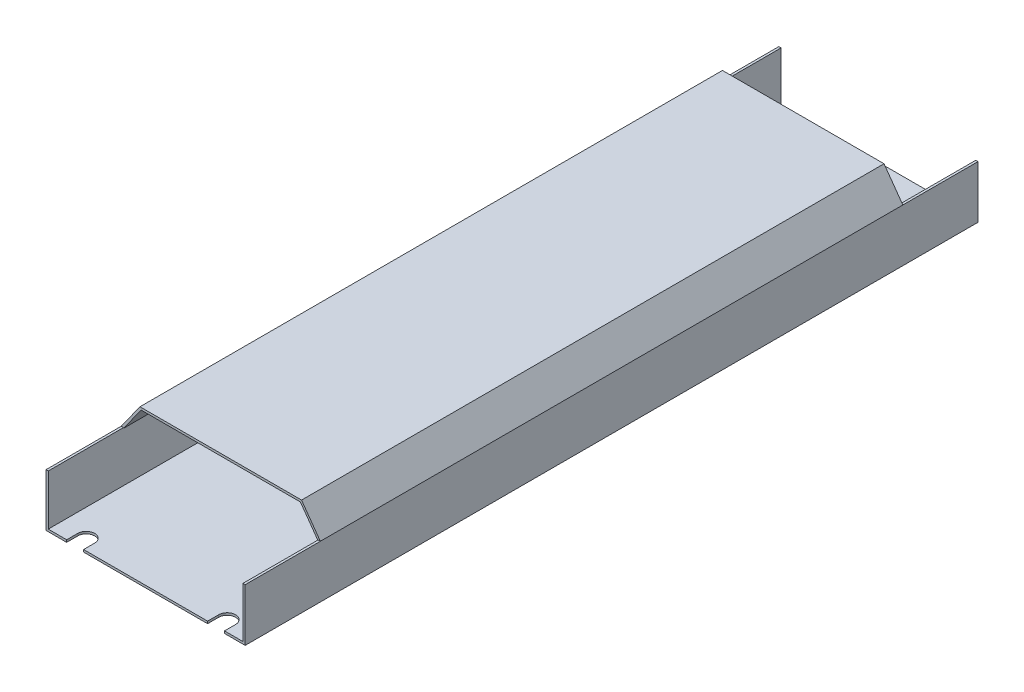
ISO-10303-21;
HEADER;
FILE_DESCRIPTION(('STEP AP214'),'2;1');
FILE_NAME('part.step','',(''),(''),'','','');
FILE_SCHEMA(('AUTOMOTIVE_DESIGN { 1 0 10303 214 1 1 1 1 }'));
ENDSEC;
DATA;
#1=APPLICATION_CONTEXT('core data for automotive mechanical design processes');
#2=APPLICATION_PROTOCOL_DEFINITION('international standard','automotive_design',2000,#1);
#3=PRODUCT_CONTEXT('',#1,'mechanical');
#4=PRODUCT('Part','Part','',(#3));
#5=PRODUCT_RELATED_PRODUCT_CATEGORY('part','',(#4));
#6=PRODUCT_DEFINITION_FORMATION('','',#4);
#7=PRODUCT_DEFINITION_CONTEXT('part definition',#1,'design');
#8=PRODUCT_DEFINITION('design','',#6,#7);
#9=PRODUCT_DEFINITION_SHAPE('','',#8);
#10=(LENGTH_UNIT() NAMED_UNIT(*) SI_UNIT(.MILLI.,.METRE.));
#11=(NAMED_UNIT(*) PLANE_ANGLE_UNIT() SI_UNIT($,.RADIAN.));
#12=(NAMED_UNIT(*) SI_UNIT($,.STERADIAN.) SOLID_ANGLE_UNIT());
#13=UNCERTAINTY_MEASURE_WITH_UNIT(LENGTH_MEASURE(1.E-05),#10,'distance_accuracy_value','');
#14=(GEOMETRIC_REPRESENTATION_CONTEXT(3) GLOBAL_UNCERTAINTY_ASSIGNED_CONTEXT((#13)) GLOBAL_UNIT_ASSIGNED_CONTEXT((#10,
#11,#12)) REPRESENTATION_CONTEXT('',''));
#15=CARTESIAN_POINT('',(0.,0.,0.));
#16=DIRECTION('',(0.,0.,1.));
#17=DIRECTION('',(1.,0.,0.));
#18=AXIS2_PLACEMENT_3D('',#15,#16,#17);
#19=CARTESIAN_POINT('',(25.9,14.,97.5));
#20=DIRECTION('',(0.,1.,0.));
#21=DIRECTION('',(0.,0.,1.));
#22=AXIS2_PLACEMENT_3D('',#19,#20,#21);
#23=PLANE('',#22);
#24=DIRECTION('',(0.,0.,-1.));
#25=VECTOR('',#24,1.);
#26=CARTESIAN_POINT('',(26.5,14.,97.5));
#27=LINE('',#26,#25);
#28=CARTESIAN_POINT('',(26.5,14.,97.5));
#29=VERTEX_POINT('',#28);
#30=CARTESIAN_POINT('',(26.5,14.,77.5));
#31=VERTEX_POINT('',#30);
#32=EDGE_CURVE('E508',#29,#31,#27,.T.);
#33=ORIENTED_EDGE('',*,*,#32,.T.);
#34=DIRECTION('',(-1.,0.,0.));
#35=VECTOR('',#34,1.);
#36=CARTESIAN_POINT('',(25.9,14.,77.5));
#37=LINE('',#36,#35);
#38=CARTESIAN_POINT('',(25.9,14.,77.5));
#39=VERTEX_POINT('',#38);
#40=EDGE_CURVE('E278',#31,#39,#37,.T.);
#41=ORIENTED_EDGE('',*,*,#40,.T.);
#42=DIRECTION('',(0.,0.,-1.));
#43=VECTOR('',#42,1.);
#44=CARTESIAN_POINT('',(25.9,14.,97.5));
#45=LINE('',#44,#43);
#46=CARTESIAN_POINT('',(25.9,14.,97.5));
#47=VERTEX_POINT('',#46);
#48=EDGE_CURVE('E504',#47,#39,#45,.T.);
#49=ORIENTED_EDGE('',*,*,#48,.F.);
#50=DIRECTION('',(1.,0.,0.));
#51=VECTOR('',#50,1.);
#52=CARTESIAN_POINT('',(25.9,14.,97.5));
#53=LINE('',#52,#51);
#54=EDGE_CURVE('E434',#47,#29,#53,.T.);
#55=ORIENTED_EDGE('',*,*,#54,.T.);
#56=EDGE_LOOP('',(#33,#41,#49,#55));
#57=FACE_BOUND('',#56,.T.);
#58=ADVANCED_FACE('F36',(#57),#23,.T.);
#59=CARTESIAN_POINT('',(25.9,0.,97.5));
#60=DIRECTION('',(-1.,0.,0.));
#61=DIRECTION('',(0.,-1.,0.));
#62=AXIS2_PLACEMENT_3D('',#59,#60,#61);
#63=PLANE('',#62);
#64=ORIENTED_EDGE('',*,*,#48,.T.);
#65=DIRECTION('',(0.,-1.,0.));
#66=VECTOR('',#65,1.);
#67=CARTESIAN_POINT('',(25.9,0.,77.5));
#68=LINE('',#67,#66);
#69=CARTESIAN_POINT('',(25.9,13.8077209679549,77.5));
#70=VERTEX_POINT('',#69);
#71=EDGE_CURVE('E330',#39,#70,#68,.T.);
#72=ORIENTED_EDGE('',*,*,#71,.T.);
#73=DIRECTION('',(0.,0.,-1.));
#74=VECTOR('',#73,1.);
#75=CARTESIAN_POINT('',(25.9,13.8077209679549,97.5));
#76=LINE('',#75,#74);
#77=CARTESIAN_POINT('',(25.9,13.8077209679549,-77.5));
#78=VERTEX_POINT('',#77);
#79=EDGE_CURVE('E11',#70,#78,#76,.T.);
#80=ORIENTED_EDGE('',*,*,#79,.T.);
#81=DIRECTION('',(0.,-1.,0.));
#82=VECTOR('',#81,1.);
#83=CARTESIAN_POINT('',(25.9,0.,-77.5));
#84=LINE('',#83,#82);
#85=CARTESIAN_POINT('',(25.9,14.,-77.5));
#86=VERTEX_POINT('',#85);
#87=EDGE_CURVE('E320',#86,#78,#84,.T.);
#88=ORIENTED_EDGE('',*,*,#87,.F.);
#89=CARTESIAN_POINT('',(25.9,14.,-97.5));
#90=VERTEX_POINT('',#89);
#91=EDGE_CURVE('E503',#86,#90,#45,.T.);
#92=ORIENTED_EDGE('',*,*,#91,.T.);
#93=DIRECTION('',(0.,1.,0.));
#94=VECTOR('',#93,1.);
#95=CARTESIAN_POINT('',(25.9,0.,-97.5));
#96=LINE('',#95,#94);
#97=CARTESIAN_POINT('',(25.9,0.6,-97.5));
#98=VERTEX_POINT('',#97);
#99=EDGE_CURVE('E465',#98,#90,#96,.T.);
#100=ORIENTED_EDGE('',*,*,#99,.F.);
#101=DIRECTION('',(0.,0.,-1.));
#102=VECTOR('',#101,1.);
#103=CARTESIAN_POINT('',(25.9,0.6,97.5));
#104=LINE('',#103,#102);
#105=CARTESIAN_POINT('',(25.9,0.6,97.5));
#106=VERTEX_POINT('',#105);
#107=EDGE_CURVE('E500',#106,#98,#104,.T.);
#108=ORIENTED_EDGE('',*,*,#107,.F.);
#109=DIRECTION('',(0.,1.,0.));
#110=VECTOR('',#109,1.);
#111=CARTESIAN_POINT('',(25.9,0.,97.5));
#112=LINE('',#111,#110);
#113=EDGE_CURVE('E438',#106,#47,#112,.T.);
#114=ORIENTED_EDGE('',*,*,#113,.T.);
#115=EDGE_LOOP('',(#64,#72,#80,#88,#92,#100,#108,#114));
#116=FACE_BOUND('',#115,.T.);
#117=ADVANCED_FACE('F573',(#116),#63,.T.);
#118=CARTESIAN_POINT('',(-25.9,14.,97.5));
#119=DIRECTION('',(1.,0.,0.));
#120=DIRECTION('',(0.,1.,0.));
#121=AXIS2_PLACEMENT_3D('',#118,#119,#120);
#122=PLANE('',#121);
#123=DIRECTION('',(0.,0.,1.));
#124=VECTOR('',#123,1.);
#125=CARTESIAN_POINT('',(-25.9,13.8077209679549,97.5));
#126=LINE('',#125,#124);
#127=CARTESIAN_POINT('',(-25.9,13.8077209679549,-77.5));
#128=VERTEX_POINT('',#127);
#129=CARTESIAN_POINT('',(-25.9,13.8077209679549,77.5));
#130=VERTEX_POINT('',#129);
#131=EDGE_CURVE('E44',#128,#130,#126,.T.);
#132=ORIENTED_EDGE('',*,*,#131,.T.);
#133=DIRECTION('',(0.,1.,0.));
#134=VECTOR('',#133,1.);
#135=CARTESIAN_POINT('',(-25.9,14.,77.5));
#136=LINE('',#135,#134);
#137=CARTESIAN_POINT('',(-25.9,14.,77.5));
#138=VERTEX_POINT('',#137);
#139=EDGE_CURVE('E327',#130,#138,#136,.T.);
#140=ORIENTED_EDGE('',*,*,#139,.T.);
#141=DIRECTION('',(0.,0.,-1.));
#142=VECTOR('',#141,1.);
#143=CARTESIAN_POINT('',(-25.9,14.,97.5));
#144=LINE('',#143,#142);
#145=CARTESIAN_POINT('',(-25.9,14.,97.5));
#146=VERTEX_POINT('',#145);
#147=EDGE_CURVE('E495',#146,#138,#144,.T.);
#148=ORIENTED_EDGE('',*,*,#147,.F.);
#149=DIRECTION('',(0.,-1.,0.));
#150=VECTOR('',#149,1.);
#151=CARTESIAN_POINT('',(-25.9,14.,97.5));
#152=LINE('',#151,#150);
#153=CARTESIAN_POINT('',(-25.9,0.6,97.5));
#154=VERTEX_POINT('',#153);
#155=EDGE_CURVE('E445',#146,#154,#152,.T.);
#156=ORIENTED_EDGE('',*,*,#155,.T.);
#157=DIRECTION('',(0.,0.,-1.));
#158=VECTOR('',#157,1.);
#159=CARTESIAN_POINT('',(-25.9,0.6,97.5));
#160=LINE('',#159,#158);
#161=CARTESIAN_POINT('',(-25.9,0.6,-97.5));
#162=VERTEX_POINT('',#161);
#163=EDGE_CURVE('E498',#154,#162,#160,.T.);
#164=ORIENTED_EDGE('',*,*,#163,.T.);
#165=DIRECTION('',(0.,-1.,0.));
#166=VECTOR('',#165,1.);
#167=CARTESIAN_POINT('',(-25.9,14.,-97.5));
#168=LINE('',#167,#166);
#169=CARTESIAN_POINT('',(-25.9,14.,-97.5));
#170=VERTEX_POINT('',#169);
#171=EDGE_CURVE('E472',#170,#162,#168,.T.);
#172=ORIENTED_EDGE('',*,*,#171,.F.);
#173=CARTESIAN_POINT('',(-25.9,14.,-77.5));
#174=VERTEX_POINT('',#173);
#175=EDGE_CURVE('E494',#174,#170,#144,.T.);
#176=ORIENTED_EDGE('',*,*,#175,.F.);
#177=DIRECTION('',(0.,1.,0.));
#178=VECTOR('',#177,1.);
#179=CARTESIAN_POINT('',(-25.9,14.,-77.5));
#180=LINE('',#179,#178);
#181=EDGE_CURVE('E318',#128,#174,#180,.T.);
#182=ORIENTED_EDGE('',*,*,#181,.F.);
#183=EDGE_LOOP('',(#132,#140,#148,#156,#164,#172,#176,#182));
#184=FACE_BOUND('',#183,.T.);
#185=ADVANCED_FACE('F512',(#184),#122,.T.);
#186=CARTESIAN_POINT('',(-26.5,14.,97.5));
#187=DIRECTION('',(0.,1.,0.));
#188=DIRECTION('',(0.,0.,1.));
#189=AXIS2_PLACEMENT_3D('',#186,#187,#188);
#190=PLANE('',#189);
#191=ORIENTED_EDGE('',*,*,#147,.T.);
#192=DIRECTION('',(-1.,0.,0.));
#193=VECTOR('',#192,1.);
#194=CARTESIAN_POINT('',(-26.5,14.,77.5));
#195=LINE('',#194,#193);
#196=CARTESIAN_POINT('',(-26.5,14.,77.5));
#197=VERTEX_POINT('',#196);
#198=EDGE_CURVE('E324',#138,#197,#195,.T.);
#199=ORIENTED_EDGE('',*,*,#198,.T.);
#200=DIRECTION('',(0.,0.,-1.));
#201=VECTOR('',#200,1.);
#202=CARTESIAN_POINT('',(-26.5,14.,97.5));
#203=LINE('',#202,#201);
#204=CARTESIAN_POINT('',(-26.5,14.,97.5));
#205=VERTEX_POINT('',#204);
#206=EDGE_CURVE('E491',#205,#197,#203,.T.);
#207=ORIENTED_EDGE('',*,*,#206,.F.);
#208=DIRECTION('',(1.,0.,0.));
#209=VECTOR('',#208,1.);
#210=CARTESIAN_POINT('',(-26.5,14.,97.5));
#211=LINE('',#210,#209);
#212=EDGE_CURVE('E449',#205,#146,#211,.T.);
#213=ORIENTED_EDGE('',*,*,#212,.T.);
#214=EDGE_LOOP('',(#191,#199,#207,#213));
#215=FACE_BOUND('',#214,.T.);
#216=ADVANCED_FACE('F534',(#215),#190,.T.);
#217=CARTESIAN_POINT('',(-26.5,0.6,97.5));
#218=DIRECTION('',(0.,1.,0.));
#219=DIRECTION('',(0.,0.,1.));
#220=AXIS2_PLACEMENT_3D('',#217,#218,#219);
#221=PLANE('',#220);
#222=CARTESIAN_POINT('',(18.75,0.6,-94.55));
#223=DIRECTION('',(0.,1.,0.));
#224=DIRECTION('',(0.,0.,1.));
#225=AXIS2_PLACEMENT_3D('',#222,#223,#224);
#226=CIRCLE('',#225,2.25);
#227=CARTESIAN_POINT('',(16.5,0.6,-94.55));
#228=VERTEX_POINT('',#227);
#229=CARTESIAN_POINT('',(21.,0.6,-94.55));
#230=VERTEX_POINT('',#229);
#231=EDGE_CURVE('E339',#228,#230,#226,.T.);
#232=ORIENTED_EDGE('',*,*,#231,.F.);
#233=DIRECTION('',(0.,0.,1.));
#234=VECTOR('',#233,1.);
#235=CARTESIAN_POINT('',(16.5,0.6,-100.45));
#236=LINE('',#235,#234);
#237=CARTESIAN_POINT('',(16.5,0.6,-97.5));
#238=VERTEX_POINT('',#237);
#239=EDGE_CURVE('E341',#238,#228,#236,.T.);
#240=ORIENTED_EDGE('',*,*,#239,.F.);
#241=DIRECTION('',(1.,0.,0.));
#242=VECTOR('',#241,1.);
#243=CARTESIAN_POINT('',(-26.5,0.6,-97.5));
#244=LINE('',#243,#242);
#245=CARTESIAN_POINT('',(-16.5,0.6,-97.5));
#246=VERTEX_POINT('',#245);
#247=EDGE_CURVE('E473',#246,#238,#244,.T.);
#248=ORIENTED_EDGE('',*,*,#247,.F.);
#249=DIRECTION('',(0.,0.,-1.));
#250=VECTOR('',#249,1.);
#251=CARTESIAN_POINT('',(-16.5,0.6,-100.45));
#252=LINE('',#251,#250);
#253=CARTESIAN_POINT('',(-16.5,0.6,-94.55));
#254=VERTEX_POINT('',#253);
#255=EDGE_CURVE('E337',#254,#246,#252,.T.);
#256=ORIENTED_EDGE('',*,*,#255,.F.);
#257=CARTESIAN_POINT('',(-18.75,0.6,-94.55));
#258=DIRECTION('',(0.,1.,0.));
#259=DIRECTION('',(0.,0.,1.));
#260=AXIS2_PLACEMENT_3D('',#257,#258,#259);
#261=CIRCLE('',#260,2.25);
#262=CARTESIAN_POINT('',(-21.,0.6,-94.55));
#263=VERTEX_POINT('',#262);
#264=EDGE_CURVE('E362',#263,#254,#261,.T.);
#265=ORIENTED_EDGE('',*,*,#264,.F.);
#266=DIRECTION('',(0.,0.,1.));
#267=VECTOR('',#266,1.);
#268=CARTESIAN_POINT('',(-21.,0.6,-100.45));
#269=LINE('',#268,#267);
#270=CARTESIAN_POINT('',(-21.,0.6,-97.5));
#271=VERTEX_POINT('',#270);
#272=EDGE_CURVE('E365',#271,#263,#269,.T.);
#273=ORIENTED_EDGE('',*,*,#272,.F.);
#274=EDGE_CURVE('E469',#162,#271,#244,.T.);
#275=ORIENTED_EDGE('',*,*,#274,.F.);
#276=ORIENTED_EDGE('',*,*,#163,.F.);
#277=DIRECTION('',(1.,0.,0.));
#278=VECTOR('',#277,1.);
#279=CARTESIAN_POINT('',(-26.5,0.6,97.5));
#280=LINE('',#279,#278);
#281=CARTESIAN_POINT('',(-21.,0.6,97.5));
#282=VERTEX_POINT('',#281);
#283=EDGE_CURVE('E442',#154,#282,#280,.T.);
#284=ORIENTED_EDGE('',*,*,#283,.T.);
#285=DIRECTION('',(0.,0.,-1.));
#286=VECTOR('',#285,1.);
#287=CARTESIAN_POINT('',(-21.,0.6,100.45));
#288=LINE('',#287,#286);
#289=CARTESIAN_POINT('',(-21.,0.6,94.55));
#290=VERTEX_POINT('',#289);
#291=EDGE_CURVE('E358',#282,#290,#288,.T.);
#292=ORIENTED_EDGE('',*,*,#291,.T.);
#293=CARTESIAN_POINT('',(-18.75,0.6,94.55));
#294=DIRECTION('',(0.,1.,0.));
#295=DIRECTION('',(0.,0.,1.));
#296=AXIS2_PLACEMENT_3D('',#293,#294,#295);
#297=CIRCLE('',#296,2.25);
#298=CARTESIAN_POINT('',(-16.5,0.6,94.55));
#299=VERTEX_POINT('',#298);
#300=EDGE_CURVE('E426',#290,#299,#297,.F.);
#301=ORIENTED_EDGE('',*,*,#300,.T.);
#302=DIRECTION('',(0.,0.,1.));
#303=VECTOR('',#302,1.);
#304=CARTESIAN_POINT('',(-16.5,0.6,100.45));
#305=LINE('',#304,#303);
#306=CARTESIAN_POINT('',(-16.5,0.6,97.5));
#307=VERTEX_POINT('',#306);
#308=EDGE_CURVE('E423',#299,#307,#305,.T.);
#309=ORIENTED_EDGE('',*,*,#308,.T.);
#310=CARTESIAN_POINT('',(16.5,0.6,97.5));
#311=VERTEX_POINT('',#310);
#312=EDGE_CURVE('E446',#307,#311,#280,.T.);
#313=ORIENTED_EDGE('',*,*,#312,.T.);
#314=DIRECTION('',(0.,0.,-1.));
#315=VECTOR('',#314,1.);
#316=CARTESIAN_POINT('',(16.5,0.6,100.45));
#317=LINE('',#316,#315);
#318=CARTESIAN_POINT('',(16.5,0.6,94.55));
#319=VERTEX_POINT('',#318);
#320=EDGE_CURVE('E404',#311,#319,#317,.T.);
#321=ORIENTED_EDGE('',*,*,#320,.T.);
#322=CARTESIAN_POINT('',(18.75,0.6,94.55));
#323=DIRECTION('',(0.,1.,0.));
#324=DIRECTION('',(0.,0.,1.));
#325=AXIS2_PLACEMENT_3D('',#322,#323,#324);
#326=CIRCLE('',#325,2.25);
#327=CARTESIAN_POINT('',(21.,0.6,94.55));
#328=VERTEX_POINT('',#327);
#329=EDGE_CURVE('E387',#319,#328,#326,.F.);
#330=ORIENTED_EDGE('',*,*,#329,.T.);
#331=DIRECTION('',(0.,0.,1.));
#332=VECTOR('',#331,1.);
#333=CARTESIAN_POINT('',(21.,0.6,100.45));
#334=LINE('',#333,#332);
#335=CARTESIAN_POINT('',(21.,0.6,97.5));
#336=VERTEX_POINT('',#335);
#337=EDGE_CURVE('E390',#328,#336,#334,.T.);
#338=ORIENTED_EDGE('',*,*,#337,.T.);
#339=EDGE_CURVE('E441',#336,#106,#280,.T.);
#340=ORIENTED_EDGE('',*,*,#339,.T.);
#341=ORIENTED_EDGE('',*,*,#107,.T.);
#342=CARTESIAN_POINT('',(21.,0.6,-97.5));
#343=VERTEX_POINT('',#342);
#344=EDGE_CURVE('E468',#343,#98,#244,.T.);
#345=ORIENTED_EDGE('',*,*,#344,.F.);
#346=DIRECTION('',(0.,0.,-1.));
#347=VECTOR('',#346,1.);
#348=CARTESIAN_POINT('',(21.,0.6,-100.45));
#349=LINE('',#348,#347);
#350=EDGE_CURVE('E355',#230,#343,#349,.T.);
#351=ORIENTED_EDGE('',*,*,#350,.F.);
#352=EDGE_LOOP('',(#232,#240,#248,#256,#265,#273,#275,#276,#284,#292,#301,#309,#313,#321,#330,
#338,#340,#341,#345,#351));
#353=FACE_BOUND('',#352,.T.);
#354=ADVANCED_FACE('F551',(#353),#221,.T.);
#355=CARTESIAN_POINT('',(-26.5,0.,97.5));
#356=DIRECTION('',(0.,1.,0.));
#357=DIRECTION('',(0.,0.,1.));
#358=AXIS2_PLACEMENT_3D('',#355,#356,#357);
#359=PLANE('',#358);
#360=DIRECTION('',(0.,0.,1.));
#361=VECTOR('',#360,1.);
#362=CARTESIAN_POINT('',(16.5,0.,-100.45));
#363=LINE('',#362,#361);
#364=CARTESIAN_POINT('',(16.5,0.,-97.5));
#365=VERTEX_POINT('',#364);
#366=CARTESIAN_POINT('',(16.5,0.,-94.55));
#367=VERTEX_POINT('',#366);
#368=EDGE_CURVE('E349',#365,#367,#363,.T.);
#369=ORIENTED_EDGE('',*,*,#368,.T.);
#370=CARTESIAN_POINT('',(18.75,0.,-94.55));
#371=DIRECTION('',(0.,1.,0.));
#372=DIRECTION('',(0.,0.,1.));
#373=AXIS2_PLACEMENT_3D('',#370,#371,#372);
#374=CIRCLE('',#373,2.25);
#375=CARTESIAN_POINT('',(21.,0.,-94.55));
#376=VERTEX_POINT('',#375);
#377=EDGE_CURVE('E346',#367,#376,#374,.T.);
#378=ORIENTED_EDGE('',*,*,#377,.T.);
#379=DIRECTION('',(0.,0.,-1.));
#380=VECTOR('',#379,1.);
#381=CARTESIAN_POINT('',(21.,0.,-100.45));
#382=LINE('',#381,#380);
#383=CARTESIAN_POINT('',(21.,0.,-97.5));
#384=VERTEX_POINT('',#383);
#385=EDGE_CURVE('E343',#376,#384,#382,.T.);
#386=ORIENTED_EDGE('',*,*,#385,.T.);
#387=DIRECTION('',(1.,0.,0.));
#388=VECTOR('',#387,1.);
#389=CARTESIAN_POINT('',(-26.5,0.,-97.5));
#390=LINE('',#389,#388);
#391=CARTESIAN_POINT('',(26.5,0.,-97.5));
#392=VERTEX_POINT('',#391);
#393=EDGE_CURVE('E481',#384,#392,#390,.T.);
#394=ORIENTED_EDGE('',*,*,#393,.T.);
#395=DIRECTION('',(0.,0.,-1.));
#396=VECTOR('',#395,1.);
#397=CARTESIAN_POINT('',(26.5,0.,97.5));
#398=LINE('',#397,#396);
#399=CARTESIAN_POINT('',(26.5,0.,97.5));
#400=VERTEX_POINT('',#399);
#401=EDGE_CURVE('E458',#400,#392,#398,.T.);
#402=ORIENTED_EDGE('',*,*,#401,.F.);
#403=DIRECTION('',(1.,0.,0.));
#404=VECTOR('',#403,1.);
#405=CARTESIAN_POINT('',(-26.5,0.,97.5));
#406=LINE('',#405,#404);
#407=CARTESIAN_POINT('',(21.,0.,97.5));
#408=VERTEX_POINT('',#407);
#409=EDGE_CURVE('E454',#408,#400,#406,.T.);
#410=ORIENTED_EDGE('',*,*,#409,.F.);
#411=DIRECTION('',(0.,0.,1.));
#412=VECTOR('',#411,1.);
#413=CARTESIAN_POINT('',(21.,0.,100.45));
#414=LINE('',#413,#412);
#415=CARTESIAN_POINT('',(21.,0.,94.55));
#416=VERTEX_POINT('',#415);
#417=EDGE_CURVE('E399',#416,#408,#414,.T.);
#418=ORIENTED_EDGE('',*,*,#417,.F.);
#419=CARTESIAN_POINT('',(18.75,0.,94.55));
#420=DIRECTION('',(0.,-1.,0.));
#421=DIRECTION('',(0.,0.,-1.));
#422=AXIS2_PLACEMENT_3D('',#419,#420,#421);
#423=CIRCLE('',#422,2.25);
#424=CARTESIAN_POINT('',(16.5,0.,94.55));
#425=VERTEX_POINT('',#424);
#426=EDGE_CURVE('E396',#425,#416,#423,.T.);
#427=ORIENTED_EDGE('',*,*,#426,.F.);
#428=DIRECTION('',(0.,0.,-1.));
#429=VECTOR('',#428,1.);
#430=CARTESIAN_POINT('',(16.5,0.,100.45));
#431=LINE('',#430,#429);
#432=CARTESIAN_POINT('',(16.5,0.,97.5));
#433=VERTEX_POINT('',#432);
#434=EDGE_CURVE('E393',#433,#425,#431,.T.);
#435=ORIENTED_EDGE('',*,*,#434,.F.);
#436=CARTESIAN_POINT('',(-16.5,0.,97.5));
#437=VERTEX_POINT('',#436);
#438=EDGE_CURVE('E459',#437,#433,#406,.T.);
#439=ORIENTED_EDGE('',*,*,#438,.F.);
#440=DIRECTION('',(0.,0.,1.));
#441=VECTOR('',#440,1.);
#442=CARTESIAN_POINT('',(-16.5,0.,100.45));
#443=LINE('',#442,#441);
#444=CARTESIAN_POINT('',(-16.5,0.,94.55));
#445=VERTEX_POINT('',#444);
#446=EDGE_CURVE('E414',#445,#437,#443,.T.);
#447=ORIENTED_EDGE('',*,*,#446,.F.);
#448=CARTESIAN_POINT('',(-18.75,0.,94.55));
#449=DIRECTION('',(0.,-1.,0.));
#450=DIRECTION('',(0.,0.,1.));
#451=AXIS2_PLACEMENT_3D('',#448,#449,#450);
#452=CIRCLE('',#451,2.25);
#453=CARTESIAN_POINT('',(-21.,0.,94.55));
#454=VERTEX_POINT('',#453);
#455=EDGE_CURVE('E417',#454,#445,#452,.T.);
#456=ORIENTED_EDGE('',*,*,#455,.F.);
#457=DIRECTION('',(0.,0.,-1.));
#458=VECTOR('',#457,1.);
#459=CARTESIAN_POINT('',(-21.,0.,100.45));
#460=LINE('',#459,#458);
#461=CARTESIAN_POINT('',(-21.,0.,97.5));
#462=VERTEX_POINT('',#461);
#463=EDGE_CURVE('E420',#462,#454,#460,.T.);
#464=ORIENTED_EDGE('',*,*,#463,.F.);
#465=CARTESIAN_POINT('',(-26.5,0.,97.5));
#466=VERTEX_POINT('',#465);
#467=EDGE_CURVE('E455',#466,#462,#406,.T.);
#468=ORIENTED_EDGE('',*,*,#467,.F.);
#469=DIRECTION('',(0.,0.,-1.));
#470=VECTOR('',#469,1.);
#471=CARTESIAN_POINT('',(-26.5,0.,97.5));
#472=LINE('',#471,#470);
#473=CARTESIAN_POINT('',(-26.5,0.,-97.5));
#474=VERTEX_POINT('',#473);
#475=EDGE_CURVE('E487',#466,#474,#472,.T.);
#476=ORIENTED_EDGE('',*,*,#475,.T.);
#477=CARTESIAN_POINT('',(-21.,0.,-97.5));
#478=VERTEX_POINT('',#477);
#479=EDGE_CURVE('E435',#474,#478,#390,.T.);
#480=ORIENTED_EDGE('',*,*,#479,.T.);
#481=DIRECTION('',(0.,0.,1.));
#482=VECTOR('',#481,1.);
#483=CARTESIAN_POINT('',(-21.,0.,-100.45));
#484=LINE('',#483,#482);
#485=CARTESIAN_POINT('',(-21.,0.,-94.55));
#486=VERTEX_POINT('',#485);
#487=EDGE_CURVE('E374',#478,#486,#484,.T.);
#488=ORIENTED_EDGE('',*,*,#487,.T.);
#489=CARTESIAN_POINT('',(-18.75,0.,-94.55));
#490=DIRECTION('',(0.,1.,0.));
#491=DIRECTION('',(0.,0.,-1.));
#492=AXIS2_PLACEMENT_3D('',#489,#490,#491);
#493=CIRCLE('',#492,2.25);
#494=CARTESIAN_POINT('',(-16.5,0.,-94.55));
#495=VERTEX_POINT('',#494);
#496=EDGE_CURVE('E371',#486,#495,#493,.T.);
#497=ORIENTED_EDGE('',*,*,#496,.T.);
#498=DIRECTION('',(0.,0.,-1.));
#499=VECTOR('',#498,1.);
#500=CARTESIAN_POINT('',(-16.5,0.,-100.45));
#501=LINE('',#500,#499);
#502=CARTESIAN_POINT('',(-16.5,0.,-97.5));
#503=VERTEX_POINT('',#502);
#504=EDGE_CURVE('E368',#495,#503,#501,.T.);
#505=ORIENTED_EDGE('',*,*,#504,.T.);
#506=EDGE_CURVE('E484',#503,#365,#390,.T.);
#507=ORIENTED_EDGE('',*,*,#506,.T.);
#508=EDGE_LOOP('',(#369,#378,#386,#394,#402,#410,#418,#427,#435,#439,#447,#456,#464,#468,#476,
#480,#488,#497,#505,#507));
#509=FACE_BOUND('',#508,.T.);
#510=ADVANCED_FACE('F611',(#509),#359,.F.);
#511=CARTESIAN_POINT('',(0.,0.,-97.5));
#512=DIRECTION('',(0.,0.,-1.));
#513=DIRECTION('',(-1.,0.,0.));
#514=AXIS2_PLACEMENT_3D('',#511,#512,#513);
#515=PLANE('',#514);
#516=ORIENTED_EDGE('',*,*,#247,.T.);
#517=DIRECTION('',(0.,1.,0.));
#518=VECTOR('',#517,1.);
#519=CARTESIAN_POINT('',(16.5,14.001,-97.5));
#520=LINE('',#519,#518);
#521=EDGE_CURVE('E336',#365,#238,#520,.T.);
#522=ORIENTED_EDGE('',*,*,#521,.F.);
#523=ORIENTED_EDGE('',*,*,#506,.F.);
#524=DIRECTION('',(0.,-1.,0.));
#525=VECTOR('',#524,1.);
#526=CARTESIAN_POINT('',(-16.5,14.001,-97.5));
#527=LINE('',#526,#525);
#528=EDGE_CURVE('E333',#246,#503,#527,.T.);
#529=ORIENTED_EDGE('',*,*,#528,.F.);
#530=EDGE_LOOP('',(#516,#522,#523,#529));
#531=FACE_BOUND('',#530,.T.);
#532=ADVANCED_FACE('F621',(#531),#515,.T.);
#533=ORIENTED_EDGE('',*,*,#393,.F.);
#534=DIRECTION('',(0.,-1.,0.));
#535=VECTOR('',#534,1.);
#536=CARTESIAN_POINT('',(21.,14.001,-97.5));
#537=LINE('',#536,#535);
#538=EDGE_CURVE('E334',#343,#384,#537,.T.);
#539=ORIENTED_EDGE('',*,*,#538,.F.);
#540=ORIENTED_EDGE('',*,*,#344,.T.);
#541=ORIENTED_EDGE('',*,*,#99,.T.);
#542=DIRECTION('',(1.,0.,0.));
#543=VECTOR('',#542,1.);
#544=CARTESIAN_POINT('',(25.9,14.,-97.5));
#545=LINE('',#544,#543);
#546=CARTESIAN_POINT('',(26.5,14.,-97.5));
#547=VERTEX_POINT('',#546);
#548=EDGE_CURVE('E462',#90,#547,#545,.T.);
#549=ORIENTED_EDGE('',*,*,#548,.T.);
#550=DIRECTION('',(0.,1.,0.));
#551=VECTOR('',#550,1.);
#552=CARTESIAN_POINT('',(26.5,0.,-97.5));
#553=LINE('',#552,#551);
#554=EDGE_CURVE('E408',#392,#547,#553,.T.);
#555=ORIENTED_EDGE('',*,*,#554,.F.);
#556=EDGE_LOOP('',(#533,#539,#540,#541,#549,#555));
#557=FACE_BOUND('',#556,.T.);
#558=ADVANCED_FACE('F600',(#557),#515,.T.);
#559=ORIENTED_EDGE('',*,*,#274,.T.);
#560=DIRECTION('',(0.,1.,0.));
#561=VECTOR('',#560,1.);
#562=CARTESIAN_POINT('',(-21.,14.001,-97.5));
#563=LINE('',#562,#561);
#564=EDGE_CURVE('E360',#478,#271,#563,.T.);
#565=ORIENTED_EDGE('',*,*,#564,.F.);
#566=ORIENTED_EDGE('',*,*,#479,.F.);
#567=DIRECTION('',(0.,-1.,0.));
#568=VECTOR('',#567,1.);
#569=CARTESIAN_POINT('',(-26.5,14.,-97.5));
#570=LINE('',#569,#568);
#571=CARTESIAN_POINT('',(-26.5,14.,-97.5));
#572=VERTEX_POINT('',#571);
#573=EDGE_CURVE('E479',#572,#474,#570,.T.);
#574=ORIENTED_EDGE('',*,*,#573,.F.);
#575=DIRECTION('',(1.,0.,0.));
#576=VECTOR('',#575,1.);
#577=CARTESIAN_POINT('',(-26.5,14.,-97.5));
#578=LINE('',#577,#576);
#579=EDGE_CURVE('E476',#572,#170,#578,.T.);
#580=ORIENTED_EDGE('',*,*,#579,.T.);
#581=ORIENTED_EDGE('',*,*,#171,.T.);
#582=EDGE_LOOP('',(#559,#565,#566,#574,#580,#581));
#583=FACE_BOUND('',#582,.T.);
#584=ADVANCED_FACE('F555',(#583),#515,.T.);
#585=CARTESIAN_POINT('',(0.,0.,97.5));
#586=DIRECTION('',(0.,0.,-1.));
#587=DIRECTION('',(-1.,0.,0.));
#588=AXIS2_PLACEMENT_3D('',#585,#586,#587);
#589=PLANE('',#588);
#590=ORIENTED_EDGE('',*,*,#339,.F.);
#591=DIRECTION('',(0.,1.,0.));
#592=VECTOR('',#591,1.);
#593=CARTESIAN_POINT('',(21.,14.001,97.5));
#594=LINE('',#593,#592);
#595=EDGE_CURVE('E384',#408,#336,#594,.T.);
#596=ORIENTED_EDGE('',*,*,#595,.F.);
#597=ORIENTED_EDGE('',*,*,#409,.T.);
#598=DIRECTION('',(0.,1.,0.));
#599=VECTOR('',#598,1.);
#600=CARTESIAN_POINT('',(26.5,0.,97.5));
#601=LINE('',#600,#599);
#602=EDGE_CURVE('E432',#400,#29,#601,.T.);
#603=ORIENTED_EDGE('',*,*,#602,.T.);
#604=ORIENTED_EDGE('',*,*,#54,.F.);
#605=ORIENTED_EDGE('',*,*,#113,.F.);
#606=EDGE_LOOP('',(#590,#596,#597,#603,#604,#605));
#607=FACE_BOUND('',#606,.T.);
#608=ADVANCED_FACE('F591',(#607),#589,.F.);
#609=ORIENTED_EDGE('',*,*,#438,.T.);
#610=DIRECTION('',(0.,-1.,0.));
#611=VECTOR('',#610,1.);
#612=CARTESIAN_POINT('',(16.5,14.001,97.5));
#613=LINE('',#612,#611);
#614=EDGE_CURVE('E382',#311,#433,#613,.T.);
#615=ORIENTED_EDGE('',*,*,#614,.F.);
#616=ORIENTED_EDGE('',*,*,#312,.F.);
#617=DIRECTION('',(0.,1.,0.));
#618=VECTOR('',#617,1.);
#619=CARTESIAN_POINT('',(-16.5,14.001,97.5));
#620=LINE('',#619,#618);
#621=EDGE_CURVE('E429',#437,#307,#620,.T.);
#622=ORIENTED_EDGE('',*,*,#621,.F.);
#623=EDGE_LOOP('',(#609,#615,#616,#622));
#624=FACE_BOUND('',#623,.T.);
#625=ADVANCED_FACE('F587',(#624),#589,.F.);
#626=CARTESIAN_POINT('',(26.5,0.,97.5));
#627=DIRECTION('',(-1.,0.,0.));
#628=DIRECTION('',(0.,-1.,0.));
#629=AXIS2_PLACEMENT_3D('',#626,#627,#628);
#630=PLANE('',#629);
#631=ORIENTED_EDGE('',*,*,#554,.T.);
#632=CARTESIAN_POINT('',(26.5,14.,-77.5));
#633=VERTEX_POINT('',#632);
#634=EDGE_CURVE('E507',#633,#547,#27,.T.);
#635=ORIENTED_EDGE('',*,*,#634,.F.);
#636=DIRECTION('',(0.,0.,-1.));
#637=VECTOR('',#636,1.);
#638=CARTESIAN_POINT('',(26.5,14.,77.5));
#639=LINE('',#638,#637);
#640=EDGE_CURVE('E58',#31,#633,#639,.T.);
#641=ORIENTED_EDGE('',*,*,#640,.F.);
#642=ORIENTED_EDGE('',*,*,#32,.F.);
#643=ORIENTED_EDGE('',*,*,#602,.F.);
#644=ORIENTED_EDGE('',*,*,#401,.T.);
#645=EDGE_LOOP('',(#631,#635,#641,#642,#643,#644));
#646=FACE_BOUND('',#645,.T.);
#647=ADVANCED_FACE('F38',(#646),#630,.F.);
#648=DIRECTION('',(-1.,0.,0.));
#649=VECTOR('',#648,1.);
#650=CARTESIAN_POINT('',(25.9,14.,-77.5));
#651=LINE('',#650,#649);
#652=EDGE_CURVE('E51',#633,#86,#651,.T.);
#653=ORIENTED_EDGE('',*,*,#652,.F.);
#654=ORIENTED_EDGE('',*,*,#634,.T.);
#655=ORIENTED_EDGE('',*,*,#548,.F.);
#656=ORIENTED_EDGE('',*,*,#91,.F.);
#657=EDGE_LOOP('',(#653,#654,#655,#656));
#658=FACE_BOUND('',#657,.T.);
#659=ADVANCED_FACE('F575',(#658),#23,.T.);
#660=DIRECTION('',(-1.,0.,0.));
#661=VECTOR('',#660,1.);
#662=CARTESIAN_POINT('',(-26.5,14.,-77.5));
#663=LINE('',#662,#661);
#664=CARTESIAN_POINT('',(-26.5,14.,-77.5));
#665=VERTEX_POINT('',#664);
#666=EDGE_CURVE('E315',#174,#665,#663,.T.);
#667=ORIENTED_EDGE('',*,*,#666,.F.);
#668=ORIENTED_EDGE('',*,*,#175,.T.);
#669=ORIENTED_EDGE('',*,*,#579,.F.);
#670=EDGE_CURVE('E490',#665,#572,#203,.T.);
#671=ORIENTED_EDGE('',*,*,#670,.F.);
#672=EDGE_LOOP('',(#667,#668,#669,#671));
#673=FACE_BOUND('',#672,.T.);
#674=ADVANCED_FACE('F561',(#673),#190,.T.);
#675=CARTESIAN_POINT('',(-26.5,14.,97.5));
#676=DIRECTION('',(1.,0.,0.));
#677=DIRECTION('',(0.,1.,0.));
#678=AXIS2_PLACEMENT_3D('',#675,#676,#677);
#679=PLANE('',#678);
#680=ORIENTED_EDGE('',*,*,#573,.T.);
#681=ORIENTED_EDGE('',*,*,#475,.F.);
#682=DIRECTION('',(0.,-1.,0.));
#683=VECTOR('',#682,1.);
#684=CARTESIAN_POINT('',(-26.5,14.,97.5));
#685=LINE('',#684,#683);
#686=EDGE_CURVE('E452',#205,#466,#685,.T.);
#687=ORIENTED_EDGE('',*,*,#686,.F.);
#688=ORIENTED_EDGE('',*,*,#206,.T.);
#689=DIRECTION('',(0.,0.,-1.));
#690=VECTOR('',#689,1.);
#691=CARTESIAN_POINT('',(-26.5,14.,77.5));
#692=LINE('',#691,#690);
#693=EDGE_CURVE('E310',#197,#665,#692,.T.);
#694=ORIENTED_EDGE('',*,*,#693,.T.);
#695=ORIENTED_EDGE('',*,*,#670,.T.);
#696=EDGE_LOOP('',(#680,#681,#687,#688,#694,#695));
#697=FACE_BOUND('',#696,.T.);
#698=ADVANCED_FACE('F537',(#697),#679,.F.);
#699=ORIENTED_EDGE('',*,*,#467,.T.);
#700=DIRECTION('',(0.,-1.,0.));
#701=VECTOR('',#700,1.);
#702=CARTESIAN_POINT('',(-21.,14.001,97.5));
#703=LINE('',#702,#701);
#704=EDGE_CURVE('E385',#282,#462,#703,.T.);
#705=ORIENTED_EDGE('',*,*,#704,.F.);
#706=ORIENTED_EDGE('',*,*,#283,.F.);
#707=ORIENTED_EDGE('',*,*,#155,.F.);
#708=ORIENTED_EDGE('',*,*,#212,.F.);
#709=ORIENTED_EDGE('',*,*,#686,.T.);
#710=EDGE_LOOP('',(#699,#705,#706,#707,#708,#709));
#711=FACE_BOUND('',#710,.T.);
#712=ADVANCED_FACE('F543',(#711),#589,.F.);
#713=CARTESIAN_POINT('',(-16.5,14.001,100.45));
#714=DIRECTION('',(1.,0.,0.));
#715=DIRECTION('',(0.,0.,-1.));
#716=AXIS2_PLACEMENT_3D('',#713,#714,#715);
#717=PLANE('',#716);
#718=DIRECTION('',(0.,-1.,0.));
#719=VECTOR('',#718,1.);
#720=CARTESIAN_POINT('',(-16.5,14.001,94.55));
#721=LINE('',#720,#719);
#722=EDGE_CURVE('E411',#299,#445,#721,.T.);
#723=ORIENTED_EDGE('',*,*,#722,.T.);
#724=ORIENTED_EDGE('',*,*,#446,.T.);
#725=ORIENTED_EDGE('',*,*,#621,.T.);
#726=ORIENTED_EDGE('',*,*,#308,.F.);
#727=EDGE_LOOP('',(#723,#724,#725,#726));
#728=FACE_BOUND('',#727,.T.);
#729=ADVANCED_FACE('F673',(#728),#717,.F.);
#730=CARTESIAN_POINT('',(-18.75,14.001,94.55));
#731=DIRECTION('',(0.,-1.,0.));
#732=DIRECTION('',(0.,0.,-1.));
#733=AXIS2_PLACEMENT_3D('',#730,#731,#732);
#734=CYLINDRICAL_SURFACE('',#733,2.25);
#735=DIRECTION('',(0.,-1.,0.));
#736=VECTOR('',#735,1.);
#737=CARTESIAN_POINT('',(-21.,14.001,94.55));
#738=LINE('',#737,#736);
#739=EDGE_CURVE('E412',#290,#454,#738,.T.);
#740=ORIENTED_EDGE('',*,*,#739,.T.);
#741=ORIENTED_EDGE('',*,*,#455,.T.);
#742=ORIENTED_EDGE('',*,*,#722,.F.);
#743=ORIENTED_EDGE('',*,*,#300,.F.);
#744=EDGE_LOOP('',(#740,#741,#742,#743));
#745=FACE_BOUND('',#744,.T.);
#746=ADVANCED_FACE('F661',(#745),#734,.F.);
#747=CARTESIAN_POINT('',(-21.,14.001,100.45));
#748=DIRECTION('',(-1.,0.,0.));
#749=DIRECTION('',(0.,0.,1.));
#750=AXIS2_PLACEMENT_3D('',#747,#748,#749);
#751=PLANE('',#750);
#752=ORIENTED_EDGE('',*,*,#704,.T.);
#753=ORIENTED_EDGE('',*,*,#463,.T.);
#754=ORIENTED_EDGE('',*,*,#739,.F.);
#755=ORIENTED_EDGE('',*,*,#291,.F.);
#756=EDGE_LOOP('',(#752,#753,#754,#755));
#757=FACE_BOUND('',#756,.T.);
#758=ADVANCED_FACE('F654',(#757),#751,.F.);
#759=CARTESIAN_POINT('',(21.,14.001,100.45));
#760=DIRECTION('',(1.,0.,0.));
#761=DIRECTION('',(0.,0.,-1.));
#762=AXIS2_PLACEMENT_3D('',#759,#760,#761);
#763=PLANE('',#762);
#764=DIRECTION('',(0.,-1.,0.));
#765=VECTOR('',#764,1.);
#766=CARTESIAN_POINT('',(21.,14.001,94.55));
#767=LINE('',#766,#765);
#768=EDGE_CURVE('E402',#328,#416,#767,.T.);
#769=ORIENTED_EDGE('',*,*,#768,.T.);
#770=ORIENTED_EDGE('',*,*,#417,.T.);
#771=ORIENTED_EDGE('',*,*,#595,.T.);
#772=ORIENTED_EDGE('',*,*,#337,.F.);
#773=EDGE_LOOP('',(#769,#770,#771,#772));
#774=FACE_BOUND('',#773,.T.);
#775=ADVANCED_FACE('F652',(#774),#763,.F.);
#776=CARTESIAN_POINT('',(18.75,14.001,94.55));
#777=DIRECTION('',(0.,-1.,0.));
#778=DIRECTION('',(0.,0.,-1.));
#779=AXIS2_PLACEMENT_3D('',#776,#777,#778);
#780=CYLINDRICAL_SURFACE('',#779,2.25);
#781=DIRECTION('',(0.,-1.,0.));
#782=VECTOR('',#781,1.);
#783=CARTESIAN_POINT('',(16.5,14.001,94.55));
#784=LINE('',#783,#782);
#785=EDGE_CURVE('E401',#319,#425,#784,.T.);
#786=ORIENTED_EDGE('',*,*,#785,.T.);
#787=ORIENTED_EDGE('',*,*,#426,.T.);
#788=ORIENTED_EDGE('',*,*,#768,.F.);
#789=ORIENTED_EDGE('',*,*,#329,.F.);
#790=EDGE_LOOP('',(#786,#787,#788,#789));
#791=FACE_BOUND('',#790,.T.);
#792=ADVANCED_FACE('F649',(#791),#780,.F.);
#793=CARTESIAN_POINT('',(16.5,14.001,100.45));
#794=DIRECTION('',(-1.,0.,0.));
#795=DIRECTION('',(0.,0.,1.));
#796=AXIS2_PLACEMENT_3D('',#793,#794,#795);
#797=PLANE('',#796);
#798=ORIENTED_EDGE('',*,*,#614,.T.);
#799=ORIENTED_EDGE('',*,*,#434,.T.);
#800=ORIENTED_EDGE('',*,*,#785,.F.);
#801=ORIENTED_EDGE('',*,*,#320,.F.);
#802=EDGE_LOOP('',(#798,#799,#800,#801));
#803=FACE_BOUND('',#802,.T.);
#804=ADVANCED_FACE('F645',(#803),#797,.F.);
#805=CARTESIAN_POINT('',(-21.,14.001,-100.45));
#806=DIRECTION('',(1.,0.,0.));
#807=DIRECTION('',(0.,0.,-1.));
#808=AXIS2_PLACEMENT_3D('',#805,#806,#807);
#809=PLANE('',#808);
#810=ORIENTED_EDGE('',*,*,#272,.T.);
#811=DIRECTION('',(0.,-1.,0.));
#812=VECTOR('',#811,1.);
#813=CARTESIAN_POINT('',(-21.,14.001,-94.55));
#814=LINE('',#813,#812);
#815=EDGE_CURVE('E378',#263,#486,#814,.T.);
#816=ORIENTED_EDGE('',*,*,#815,.T.);
#817=ORIENTED_EDGE('',*,*,#487,.F.);
#818=ORIENTED_EDGE('',*,*,#564,.T.);
#819=EDGE_LOOP('',(#810,#816,#817,#818));
#820=FACE_BOUND('',#819,.T.);
#821=ADVANCED_FACE('F669',(#820),#809,.T.);
#822=CARTESIAN_POINT('',(-18.75,14.001,-94.55));
#823=DIRECTION('',(0.,-1.,0.));
#824=DIRECTION('',(0.,0.,-1.));
#825=AXIS2_PLACEMENT_3D('',#822,#823,#824);
#826=CYLINDRICAL_SURFACE('',#825,2.25);
#827=ORIENTED_EDGE('',*,*,#264,.T.);
#828=DIRECTION('',(0.,-1.,0.));
#829=VECTOR('',#828,1.);
#830=CARTESIAN_POINT('',(-16.5,14.001,-94.55));
#831=LINE('',#830,#829);
#832=EDGE_CURVE('E377',#254,#495,#831,.T.);
#833=ORIENTED_EDGE('',*,*,#832,.T.);
#834=ORIENTED_EDGE('',*,*,#496,.F.);
#835=ORIENTED_EDGE('',*,*,#815,.F.);
#836=EDGE_LOOP('',(#827,#833,#834,#835));
#837=FACE_BOUND('',#836,.T.);
#838=ADVANCED_FACE('F744',(#837),#826,.F.);
#839=CARTESIAN_POINT('',(-16.5,14.001,-100.45));
#840=DIRECTION('',(-1.,0.,0.));
#841=DIRECTION('',(0.,0.,1.));
#842=AXIS2_PLACEMENT_3D('',#839,#840,#841);
#843=PLANE('',#842);
#844=ORIENTED_EDGE('',*,*,#255,.T.);
#845=ORIENTED_EDGE('',*,*,#528,.T.);
#846=ORIENTED_EDGE('',*,*,#504,.F.);
#847=ORIENTED_EDGE('',*,*,#832,.F.);
#848=EDGE_LOOP('',(#844,#845,#846,#847));
#849=FACE_BOUND('',#848,.T.);
#850=ADVANCED_FACE('F665',(#849),#843,.T.);
#851=CARTESIAN_POINT('',(16.5,14.001,-100.45));
#852=DIRECTION('',(1.,0.,0.));
#853=DIRECTION('',(0.,0.,-1.));
#854=AXIS2_PLACEMENT_3D('',#851,#852,#853);
#855=PLANE('',#854);
#856=ORIENTED_EDGE('',*,*,#239,.T.);
#857=DIRECTION('',(0.,-1.,0.));
#858=VECTOR('',#857,1.);
#859=CARTESIAN_POINT('',(16.5,14.001,-94.55));
#860=LINE('',#859,#858);
#861=EDGE_CURVE('E353',#228,#367,#860,.T.);
#862=ORIENTED_EDGE('',*,*,#861,.T.);
#863=ORIENTED_EDGE('',*,*,#368,.F.);
#864=ORIENTED_EDGE('',*,*,#521,.T.);
#865=EDGE_LOOP('',(#856,#862,#863,#864));
#866=FACE_BOUND('',#865,.T.);
#867=ADVANCED_FACE('F625',(#866),#855,.T.);
#868=CARTESIAN_POINT('',(18.75,14.001,-94.55));
#869=DIRECTION('',(0.,-1.,0.));
#870=DIRECTION('',(0.,0.,-1.));
#871=AXIS2_PLACEMENT_3D('',#868,#869,#870);
#872=CYLINDRICAL_SURFACE('',#871,2.25);
#873=ORIENTED_EDGE('',*,*,#231,.T.);
#874=DIRECTION('',(0.,-1.,0.));
#875=VECTOR('',#874,1.);
#876=CARTESIAN_POINT('',(21.,14.001,-94.55));
#877=LINE('',#876,#875);
#878=EDGE_CURVE('E352',#230,#376,#877,.T.);
#879=ORIENTED_EDGE('',*,*,#878,.T.);
#880=ORIENTED_EDGE('',*,*,#377,.F.);
#881=ORIENTED_EDGE('',*,*,#861,.F.);
#882=EDGE_LOOP('',(#873,#879,#880,#881));
#883=FACE_BOUND('',#882,.T.);
#884=ADVANCED_FACE('F632',(#883),#872,.F.);
#885=CARTESIAN_POINT('',(21.,14.001,-100.45));
#886=DIRECTION('',(-1.,0.,0.));
#887=DIRECTION('',(0.,0.,1.));
#888=AXIS2_PLACEMENT_3D('',#885,#886,#887);
#889=PLANE('',#888);
#890=ORIENTED_EDGE('',*,*,#350,.T.);
#891=ORIENTED_EDGE('',*,*,#538,.T.);
#892=ORIENTED_EDGE('',*,*,#385,.F.);
#893=ORIENTED_EDGE('',*,*,#878,.F.);
#894=EDGE_LOOP('',(#890,#891,#892,#893));
#895=FACE_BOUND('',#894,.T.);
#896=ADVANCED_FACE('F635',(#895),#889,.T.);
#897=CARTESIAN_POINT('',(21.011759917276,20.6512570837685,77.5));
#898=DIRECTION('',(0.813733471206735,0.581238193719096,0.));
#899=DIRECTION('',(-0.581238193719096,0.813733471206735,0.));
#900=AXIS2_PLACEMENT_3D('',#897,#898,#899);
#901=PLANE('',#900);
#902=ORIENTED_EDGE('',*,*,#79,.F.);
#903=DIRECTION('',(0.581238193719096,-0.813733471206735,0.));
#904=VECTOR('',#903,1.);
#905=CARTESIAN_POINT('',(21.011759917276,20.6512570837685,77.5));
#906=LINE('',#905,#904);
#907=CARTESIAN_POINT('',(21.1912292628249,20.4,77.5));
#908=VERTEX_POINT('',#907);
#909=EDGE_CURVE('E279',#908,#70,#906,.T.);
#910=ORIENTED_EDGE('',*,*,#909,.F.);
#911=DIRECTION('',(0.,0.,-1.));
#912=VECTOR('',#911,1.);
#913=CARTESIAN_POINT('',(21.1912292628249,20.4,77.5));
#914=LINE('',#913,#912);
#915=CARTESIAN_POINT('',(21.1912292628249,20.4,-77.5));
#916=VERTEX_POINT('',#915);
#917=EDGE_CURVE('E291',#908,#916,#914,.T.);
#918=ORIENTED_EDGE('',*,*,#917,.T.);
#919=DIRECTION('',(0.581238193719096,-0.813733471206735,0.));
#920=VECTOR('',#919,1.);
#921=CARTESIAN_POINT('',(21.011759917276,20.6512570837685,-77.5));
#922=LINE('',#921,#920);
#923=EDGE_CURVE('E292',#916,#78,#922,.T.);
#924=ORIENTED_EDGE('',*,*,#923,.T.);
#925=EDGE_LOOP('',(#902,#910,#918,#924));
#926=FACE_BOUND('',#925,.T.);
#927=ADVANCED_FACE('F531',(#926),#901,.F.);
#928=CARTESIAN_POINT('',(21.5,21.,77.5));
#929=DIRECTION('',(0.813733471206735,0.581238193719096,0.));
#930=DIRECTION('',(-0.581238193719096,0.813733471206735,0.));
#931=AXIS2_PLACEMENT_3D('',#928,#929,#930);
#932=PLANE('',#931);
#933=DIRECTION('',(0.581238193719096,-0.813733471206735,0.));
#934=VECTOR('',#933,1.);
#935=CARTESIAN_POINT('',(21.5,21.,-77.5));
#936=LINE('',#935,#934);
#937=CARTESIAN_POINT('',(21.5,21.,-77.5));
#938=VERTEX_POINT('',#937);
#939=EDGE_CURVE('E263',#938,#633,#936,.T.);
#940=ORIENTED_EDGE('',*,*,#939,.F.);
#941=DIRECTION('',(0.,0.,-1.));
#942=VECTOR('',#941,1.);
#943=CARTESIAN_POINT('',(21.5,21.,77.5));
#944=LINE('',#943,#942);
#945=CARTESIAN_POINT('',(21.5,21.,77.5));
#946=VERTEX_POINT('',#945);
#947=EDGE_CURVE('E258',#946,#938,#944,.T.);
#948=ORIENTED_EDGE('',*,*,#947,.F.);
#949=DIRECTION('',(0.581238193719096,-0.813733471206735,0.));
#950=VECTOR('',#949,1.);
#951=CARTESIAN_POINT('',(21.5,21.,77.5));
#952=LINE('',#951,#950);
#953=EDGE_CURVE('E261',#946,#31,#952,.T.);
#954=ORIENTED_EDGE('',*,*,#953,.T.);
#955=ORIENTED_EDGE('',*,*,#640,.T.);
#956=EDGE_LOOP('',(#940,#948,#954,#955));
#957=FACE_BOUND('',#956,.T.);
#958=ADVANCED_FACE('F260',(#957),#932,.T.);
#959=CARTESIAN_POINT('',(-21.5,21.,77.5));
#960=DIRECTION('',(0.,1.,0.));
#961=DIRECTION('',(0.,0.,1.));
#962=AXIS2_PLACEMENT_3D('',#959,#960,#961);
#963=PLANE('',#962);
#964=DIRECTION('',(1.,0.,0.));
#965=VECTOR('',#964,1.);
#966=CARTESIAN_POINT('',(-21.5,21.,-77.5));
#967=LINE('',#966,#965);
#968=CARTESIAN_POINT('',(-21.5,21.,-77.5));
#969=VERTEX_POINT('',#968);
#970=EDGE_CURVE('E296',#969,#938,#967,.T.);
#971=ORIENTED_EDGE('',*,*,#970,.F.);
#972=DIRECTION('',(0.,0.,-1.));
#973=VECTOR('',#972,1.);
#974=CARTESIAN_POINT('',(-21.5,21.,77.5));
#975=LINE('',#974,#973);
#976=CARTESIAN_POINT('',(-21.5,21.,77.5));
#977=VERTEX_POINT('',#976);
#978=EDGE_CURVE('E268',#977,#969,#975,.T.);
#979=ORIENTED_EDGE('',*,*,#978,.F.);
#980=DIRECTION('',(1.,0.,0.));
#981=VECTOR('',#980,1.);
#982=CARTESIAN_POINT('',(-21.5,21.,77.5));
#983=LINE('',#982,#981);
#984=EDGE_CURVE('E275',#977,#946,#983,.T.);
#985=ORIENTED_EDGE('',*,*,#984,.T.);
#986=ORIENTED_EDGE('',*,*,#947,.T.);
#987=EDGE_LOOP('',(#971,#979,#985,#986));
#988=FACE_BOUND('',#987,.T.);
#989=ADVANCED_FACE('F281',(#988),#963,.T.);
#990=CARTESIAN_POINT('',(-26.5,14.,77.5));
#991=DIRECTION('',(-0.813733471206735,0.581238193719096,0.));
#992=DIRECTION('',(-0.581238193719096,-0.813733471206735,0.));
#993=AXIS2_PLACEMENT_3D('',#990,#991,#992);
#994=PLANE('',#993);
#995=DIRECTION('',(0.581238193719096,0.813733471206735,0.));
#996=VECTOR('',#995,1.);
#997=CARTESIAN_POINT('',(-26.5,14.,-77.5));
#998=LINE('',#997,#996);
#999=EDGE_CURVE('E298',#665,#969,#998,.T.);
#1000=ORIENTED_EDGE('',*,*,#999,.F.);
#1001=ORIENTED_EDGE('',*,*,#693,.F.);
#1002=DIRECTION('',(0.581238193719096,0.813733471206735,0.));
#1003=VECTOR('',#1002,1.);
#1004=CARTESIAN_POINT('',(-26.5,14.,77.5));
#1005=LINE('',#1004,#1003);
#1006=EDGE_CURVE('E282',#197,#977,#1005,.T.);
#1007=ORIENTED_EDGE('',*,*,#1006,.T.);
#1008=ORIENTED_EDGE('',*,*,#978,.T.);
#1009=EDGE_LOOP('',(#1000,#1001,#1007,#1008));
#1010=FACE_BOUND('',#1009,.T.);
#1011=ADVANCED_FACE('F563',(#1010),#994,.T.);
#1012=CARTESIAN_POINT('',(-26.011759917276,13.6512570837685,77.5));
#1013=DIRECTION('',(-0.813733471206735,0.581238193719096,0.));
#1014=DIRECTION('',(-0.581238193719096,-0.813733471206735,0.));
#1015=AXIS2_PLACEMENT_3D('',#1012,#1013,#1014);
#1016=PLANE('',#1015);
#1017=ORIENTED_EDGE('',*,*,#131,.F.);
#1018=DIRECTION('',(0.581238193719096,0.813733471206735,0.));
#1019=VECTOR('',#1018,1.);
#1020=CARTESIAN_POINT('',(-26.011759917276,13.6512570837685,-77.5));
#1021=LINE('',#1020,#1019);
#1022=CARTESIAN_POINT('',(-21.1912292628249,20.4,-77.5));
#1023=VERTEX_POINT('',#1022);
#1024=EDGE_CURVE('E301',#128,#1023,#1021,.T.);
#1025=ORIENTED_EDGE('',*,*,#1024,.T.);
#1026=DIRECTION('',(0.,0.,-1.));
#1027=VECTOR('',#1026,1.);
#1028=CARTESIAN_POINT('',(-21.1912292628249,20.4,77.5));
#1029=LINE('',#1028,#1027);
#1030=CARTESIAN_POINT('',(-21.1912292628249,20.4,77.5));
#1031=VERTEX_POINT('',#1030);
#1032=EDGE_CURVE('E307',#1031,#1023,#1029,.T.);
#1033=ORIENTED_EDGE('',*,*,#1032,.F.);
#1034=DIRECTION('',(0.581238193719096,0.813733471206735,0.));
#1035=VECTOR('',#1034,1.);
#1036=CARTESIAN_POINT('',(-26.011759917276,13.6512570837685,77.5));
#1037=LINE('',#1036,#1035);
#1038=EDGE_CURVE('E284',#130,#1031,#1037,.T.);
#1039=ORIENTED_EDGE('',*,*,#1038,.F.);
#1040=EDGE_LOOP('',(#1017,#1025,#1033,#1039));
#1041=FACE_BOUND('',#1040,.T.);
#1042=ADVANCED_FACE('F517',(#1041),#1016,.F.);
#1043=CARTESIAN_POINT('',(-21.5,20.4,77.5));
#1044=DIRECTION('',(0.,1.,0.));
#1045=DIRECTION('',(0.,0.,1.));
#1046=AXIS2_PLACEMENT_3D('',#1043,#1044,#1045);
#1047=PLANE('',#1046);
#1048=DIRECTION('',(1.,0.,0.));
#1049=VECTOR('',#1048,1.);
#1050=CARTESIAN_POINT('',(-21.5,20.4,-77.5));
#1051=LINE('',#1050,#1049);
#1052=EDGE_CURVE('E303',#1023,#916,#1051,.T.);
#1053=ORIENTED_EDGE('',*,*,#1052,.T.);
#1054=ORIENTED_EDGE('',*,*,#917,.F.);
#1055=DIRECTION('',(1.,0.,0.));
#1056=VECTOR('',#1055,1.);
#1057=CARTESIAN_POINT('',(-21.5,20.4,77.5));
#1058=LINE('',#1057,#1056);
#1059=EDGE_CURVE('E289',#1031,#908,#1058,.T.);
#1060=ORIENTED_EDGE('',*,*,#1059,.F.);
#1061=ORIENTED_EDGE('',*,*,#1032,.T.);
#1062=EDGE_LOOP('',(#1053,#1054,#1060,#1061));
#1063=FACE_BOUND('',#1062,.T.);
#1064=ADVANCED_FACE('F526',(#1063),#1047,.F.);
#1065=CARTESIAN_POINT('',(0.,0.,77.5));
#1066=DIRECTION('',(0.,0.,-1.));
#1067=DIRECTION('',(-1.,0.,0.));
#1068=AXIS2_PLACEMENT_3D('',#1065,#1066,#1067);
#1069=PLANE('',#1068);
#1070=ORIENTED_EDGE('',*,*,#40,.F.);
#1071=ORIENTED_EDGE('',*,*,#953,.F.);
#1072=ORIENTED_EDGE('',*,*,#984,.F.);
#1073=ORIENTED_EDGE('',*,*,#1006,.F.);
#1074=ORIENTED_EDGE('',*,*,#198,.F.);
#1075=ORIENTED_EDGE('',*,*,#139,.F.);
#1076=ORIENTED_EDGE('',*,*,#1038,.T.);
#1077=ORIENTED_EDGE('',*,*,#1059,.T.);
#1078=ORIENTED_EDGE('',*,*,#909,.T.);
#1079=ORIENTED_EDGE('',*,*,#71,.F.);
#1080=EDGE_LOOP('',(#1070,#1071,#1072,#1073,#1074,#1075,#1076,#1077,#1078,#1079));
#1081=FACE_BOUND('',#1080,.T.);
#1082=ADVANCED_FACE('F273',(#1081),#1069,.F.);
#1083=CARTESIAN_POINT('',(0.,0.,-77.5));
#1084=DIRECTION('',(0.,0.,-1.));
#1085=DIRECTION('',(-1.,0.,0.));
#1086=AXIS2_PLACEMENT_3D('',#1083,#1084,#1085);
#1087=PLANE('',#1086);
#1088=ORIENTED_EDGE('',*,*,#939,.T.);
#1089=ORIENTED_EDGE('',*,*,#652,.T.);
#1090=ORIENTED_EDGE('',*,*,#87,.T.);
#1091=ORIENTED_EDGE('',*,*,#923,.F.);
#1092=ORIENTED_EDGE('',*,*,#1052,.F.);
#1093=ORIENTED_EDGE('',*,*,#1024,.F.);
#1094=ORIENTED_EDGE('',*,*,#181,.T.);
#1095=ORIENTED_EDGE('',*,*,#666,.T.);
#1096=ORIENTED_EDGE('',*,*,#999,.T.);
#1097=ORIENTED_EDGE('',*,*,#970,.T.);
#1098=EDGE_LOOP('',(#1088,#1089,#1090,#1091,#1092,#1093,#1094,#1095,#1096,#1097));
#1099=FACE_BOUND('',#1098,.T.);
#1100=ADVANCED_FACE('F521',(#1099),#1087,.T.);
#1101=CLOSED_SHELL('',(#58,#117,#185,#216,#354,#510,#532,#558,#584,#608,#625,#647,#659,#674,
#698,#712,#729,#746,#758,#775,#792,#804,#821,#838,#850,#867,#884,#896,#927,#958,#989,#1011,
#1042,#1064,#1082,#1100));
#1102=MANIFOLD_SOLID_BREP('B2',#1101);
#1103=ADVANCED_BREP_SHAPE_REPRESENTATION('',(#18,#1102),#14);
#1104=SHAPE_DEFINITION_REPRESENTATION(#9,#1103);
ENDSEC;
END-ISO-10303-21;
